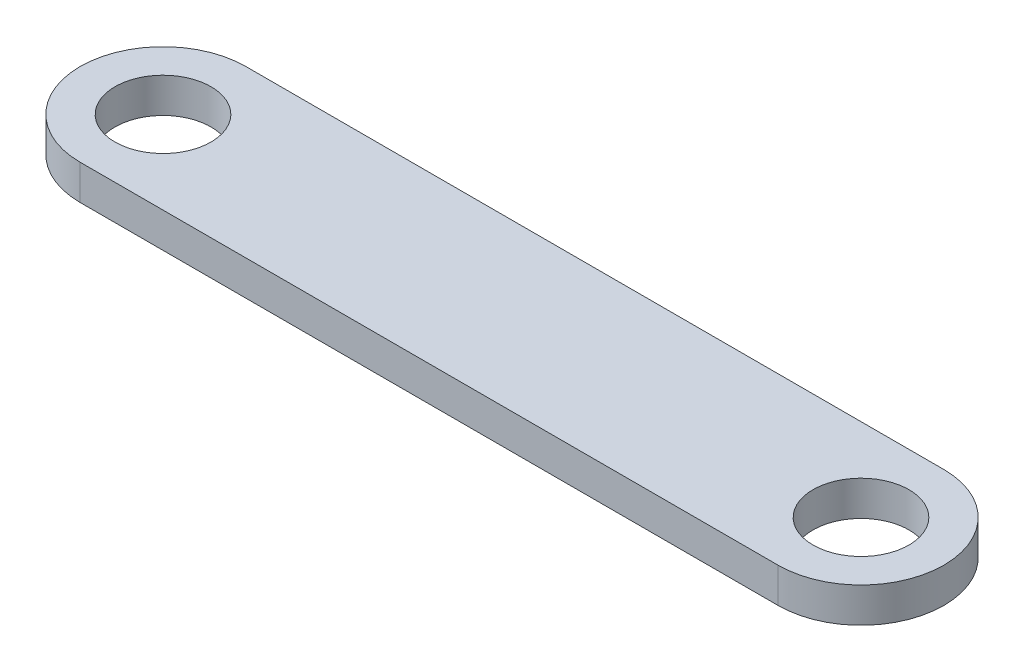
ISO-10303-21;
HEADER;
FILE_DESCRIPTION(('STEP AP214'),'2;1');
FILE_NAME('part.step','',(''),(''),'','','');
FILE_SCHEMA(('AUTOMOTIVE_DESIGN { 1 0 10303 214 1 1 1 1 }'));
ENDSEC;
DATA;
#1=APPLICATION_CONTEXT('core data for automotive mechanical design processes');
#2=APPLICATION_PROTOCOL_DEFINITION('international standard','automotive_design',2000,#1);
#3=PRODUCT_CONTEXT('',#1,'mechanical');
#4=PRODUCT('Part','Part','',(#3));
#5=PRODUCT_RELATED_PRODUCT_CATEGORY('part','',(#4));
#6=PRODUCT_DEFINITION_FORMATION('','',#4);
#7=PRODUCT_DEFINITION_CONTEXT('part definition',#1,'design');
#8=PRODUCT_DEFINITION('design','',#6,#7);
#9=PRODUCT_DEFINITION_SHAPE('','',#8);
#10=(LENGTH_UNIT() NAMED_UNIT(*) SI_UNIT(.MILLI.,.METRE.));
#11=(NAMED_UNIT(*) PLANE_ANGLE_UNIT() SI_UNIT($,.RADIAN.));
#12=(NAMED_UNIT(*) SI_UNIT($,.STERADIAN.) SOLID_ANGLE_UNIT());
#13=UNCERTAINTY_MEASURE_WITH_UNIT(LENGTH_MEASURE(1.E-05),#10,'distance_accuracy_value','');
#14=(GEOMETRIC_REPRESENTATION_CONTEXT(3) GLOBAL_UNCERTAINTY_ASSIGNED_CONTEXT((#13)) GLOBAL_UNIT_ASSIGNED_CONTEXT((#10,
#11,#12)) REPRESENTATION_CONTEXT('',''));
#15=CARTESIAN_POINT('',(0.,0.,0.));
#16=DIRECTION('',(0.,0.,1.));
#17=DIRECTION('',(1.,0.,0.));
#18=AXIS2_PLACEMENT_3D('',#15,#16,#17);
#19=CARTESIAN_POINT('',(-20.,2.,0.));
#20=DIRECTION('',(0.,1.,0.));
#21=DIRECTION('',(0.,0.,1.));
#22=AXIS2_PLACEMENT_3D('',#19,#20,#21);
#23=PLANE('',#22);
#24=CARTESIAN_POINT('',(-20.,2.,0.));
#25=DIRECTION('',(0.,1.,0.));
#26=DIRECTION('',(0.,0.,1.));
#27=AXIS2_PLACEMENT_3D('',#24,#25,#26);
#28=CIRCLE('',#27,2.75);
#29=CARTESIAN_POINT('',(-20.,2.,2.75));
#30=VERTEX_POINT('',#29);
#31=EDGE_CURVE('E113',#30,#30,#28,.T.);
#32=ORIENTED_EDGE('',*,*,#31,.F.);
#33=EDGE_LOOP('',(#32));
#34=FACE_BOUND('',#33,.T.);
#35=CARTESIAN_POINT('',(-20.,2.,0.));
#36=DIRECTION('',(0.,1.,0.));
#37=DIRECTION('',(0.,0.,1.));
#38=AXIS2_PLACEMENT_3D('',#35,#36,#37);
#39=CIRCLE('',#38,4.75);
#40=CARTESIAN_POINT('',(-20.,2.,-4.75));
#41=VERTEX_POINT('',#40);
#42=CARTESIAN_POINT('',(-20.,2.,4.75));
#43=VERTEX_POINT('',#42);
#44=EDGE_CURVE('E92',#41,#43,#39,.T.);
#45=ORIENTED_EDGE('',*,*,#44,.T.);
#46=DIRECTION('',(1.,0.,0.));
#47=VECTOR('',#46,1.);
#48=CARTESIAN_POINT('',(-20.,2.,4.75));
#49=LINE('',#48,#47);
#50=CARTESIAN_POINT('',(20.,2.,4.75));
#51=VERTEX_POINT('',#50);
#52=EDGE_CURVE('E87',#43,#51,#49,.T.);
#53=ORIENTED_EDGE('',*,*,#52,.T.);
#54=CARTESIAN_POINT('',(20.,2.,0.));
#55=DIRECTION('',(0.,1.,0.));
#56=DIRECTION('',(0.,0.,1.));
#57=AXIS2_PLACEMENT_3D('',#54,#55,#56);
#58=CIRCLE('',#57,4.75);
#59=CARTESIAN_POINT('',(20.,2.,-4.75));
#60=VERTEX_POINT('',#59);
#61=EDGE_CURVE('E90',#51,#60,#58,.T.);
#62=ORIENTED_EDGE('',*,*,#61,.T.);
#63=DIRECTION('',(-1.,0.,0.));
#64=VECTOR('',#63,1.);
#65=CARTESIAN_POINT('',(-20.,2.,-4.75));
#66=LINE('',#65,#64);
#67=EDGE_CURVE('E57',#60,#41,#66,.T.);
#68=ORIENTED_EDGE('',*,*,#67,.T.);
#69=EDGE_LOOP('',(#45,#53,#62,#68));
#70=FACE_BOUND('',#69,.T.);
#71=CARTESIAN_POINT('',(20.,2.,0.));
#72=DIRECTION('',(0.,1.,0.));
#73=DIRECTION('',(0.,0.,1.));
#74=AXIS2_PLACEMENT_3D('',#71,#72,#73);
#75=CIRCLE('',#74,2.75);
#76=CARTESIAN_POINT('',(20.,2.,2.75));
#77=VERTEX_POINT('',#76);
#78=EDGE_CURVE('E136',#77,#77,#75,.T.);
#79=ORIENTED_EDGE('',*,*,#78,.F.);
#80=EDGE_LOOP('',(#79));
#81=FACE_BOUND('',#80,.T.);
#82=ADVANCED_FACE('F39',(#34,#70,#81),#23,.T.);
#83=CARTESIAN_POINT('',(-20.,0.,0.));
#84=DIRECTION('',(0.,1.,0.));
#85=DIRECTION('',(0.,0.,1.));
#86=AXIS2_PLACEMENT_3D('',#83,#84,#85);
#87=PLANE('',#86);
#88=CARTESIAN_POINT('',(-20.,0.,0.));
#89=DIRECTION('',(0.,1.,0.));
#90=DIRECTION('',(0.,0.,1.));
#91=AXIS2_PLACEMENT_3D('',#88,#89,#90);
#92=CIRCLE('',#91,4.75);
#93=CARTESIAN_POINT('',(-20.,0.,-4.75));
#94=VERTEX_POINT('',#93);
#95=CARTESIAN_POINT('',(-20.,0.,4.75));
#96=VERTEX_POINT('',#95);
#97=EDGE_CURVE('E109',#94,#96,#92,.T.);
#98=ORIENTED_EDGE('',*,*,#97,.F.);
#99=DIRECTION('',(-1.,0.,0.));
#100=VECTOR('',#99,1.);
#101=CARTESIAN_POINT('',(-20.,0.,-4.75));
#102=LINE('',#101,#100);
#103=CARTESIAN_POINT('',(20.,0.,-4.75));
#104=VERTEX_POINT('',#103);
#105=EDGE_CURVE('E80',#104,#94,#102,.T.);
#106=ORIENTED_EDGE('',*,*,#105,.F.);
#107=CARTESIAN_POINT('',(20.,0.,0.));
#108=DIRECTION('',(0.,1.,0.));
#109=DIRECTION('',(0.,0.,1.));
#110=AXIS2_PLACEMENT_3D('',#107,#108,#109);
#111=CIRCLE('',#110,4.75);
#112=CARTESIAN_POINT('',(20.,0.,4.75));
#113=VERTEX_POINT('',#112);
#114=EDGE_CURVE('E74',#113,#104,#111,.T.);
#115=ORIENTED_EDGE('',*,*,#114,.F.);
#116=DIRECTION('',(1.,0.,0.));
#117=VECTOR('',#116,1.);
#118=CARTESIAN_POINT('',(-20.,0.,4.75));
#119=LINE('',#118,#117);
#120=EDGE_CURVE('E97',#96,#113,#119,.T.);
#121=ORIENTED_EDGE('',*,*,#120,.F.);
#122=EDGE_LOOP('',(#98,#106,#115,#121));
#123=FACE_BOUND('',#122,.T.);
#124=CARTESIAN_POINT('',(-20.,0.,0.));
#125=DIRECTION('',(0.,1.,0.));
#126=DIRECTION('',(0.,0.,1.));
#127=AXIS2_PLACEMENT_3D('',#124,#125,#126);
#128=CIRCLE('',#127,2.75);
#129=CARTESIAN_POINT('',(-20.,0.,2.75));
#130=VERTEX_POINT('',#129);
#131=EDGE_CURVE('E132',#130,#130,#128,.T.);
#132=ORIENTED_EDGE('',*,*,#131,.T.);
#133=EDGE_LOOP('',(#132));
#134=FACE_BOUND('',#133,.T.);
#135=CARTESIAN_POINT('',(20.,0.,0.));
#136=DIRECTION('',(0.,1.,0.));
#137=DIRECTION('',(0.,0.,1.));
#138=AXIS2_PLACEMENT_3D('',#135,#136,#137);
#139=CIRCLE('',#138,2.75);
#140=CARTESIAN_POINT('',(20.,0.,2.75));
#141=VERTEX_POINT('',#140);
#142=EDGE_CURVE('E139',#141,#141,#139,.T.);
#143=ORIENTED_EDGE('',*,*,#142,.T.);
#144=EDGE_LOOP('',(#143));
#145=FACE_BOUND('',#144,.T.);
#146=ADVANCED_FACE('F125',(#123,#134,#145),#87,.F.);
#147=CARTESIAN_POINT('',(-20.,2.,0.));
#148=DIRECTION('',(0.,-1.,0.));
#149=DIRECTION('',(0.,0.,-1.));
#150=AXIS2_PLACEMENT_3D('',#147,#148,#149);
#151=CYLINDRICAL_SURFACE('',#150,4.75);
#152=ORIENTED_EDGE('',*,*,#97,.T.);
#153=DIRECTION('',(0.,-1.,0.));
#154=VECTOR('',#153,1.);
#155=CARTESIAN_POINT('',(-20.,2.,4.75));
#156=LINE('',#155,#154);
#157=EDGE_CURVE('E11',#43,#96,#156,.T.);
#158=ORIENTED_EDGE('',*,*,#157,.F.);
#159=ORIENTED_EDGE('',*,*,#44,.F.);
#160=DIRECTION('',(0.,-1.,0.));
#161=VECTOR('',#160,1.);
#162=CARTESIAN_POINT('',(-20.,2.,-4.75));
#163=LINE('',#162,#161);
#164=EDGE_CURVE('E105',#41,#94,#163,.T.);
#165=ORIENTED_EDGE('',*,*,#164,.T.);
#166=EDGE_LOOP('',(#152,#158,#159,#165));
#167=FACE_BOUND('',#166,.T.);
#168=ADVANCED_FACE('F41',(#167),#151,.T.);
#169=CARTESIAN_POINT('',(-20.,2.,4.75));
#170=DIRECTION('',(0.,0.,-1.));
#171=DIRECTION('',(-1.,0.,0.));
#172=AXIS2_PLACEMENT_3D('',#169,#170,#171);
#173=PLANE('',#172);
#174=ORIENTED_EDGE('',*,*,#120,.T.);
#175=DIRECTION('',(0.,-1.,0.));
#176=VECTOR('',#175,1.);
#177=CARTESIAN_POINT('',(20.,2.,4.75));
#178=LINE('',#177,#176);
#179=EDGE_CURVE('E49',#51,#113,#178,.T.);
#180=ORIENTED_EDGE('',*,*,#179,.F.);
#181=ORIENTED_EDGE('',*,*,#52,.F.);
#182=ORIENTED_EDGE('',*,*,#157,.T.);
#183=EDGE_LOOP('',(#174,#180,#181,#182));
#184=FACE_BOUND('',#183,.T.);
#185=ADVANCED_FACE('F96',(#184),#173,.F.);
#186=CARTESIAN_POINT('',(20.,2.,0.));
#187=DIRECTION('',(0.,-1.,0.));
#188=DIRECTION('',(0.,0.,-1.));
#189=AXIS2_PLACEMENT_3D('',#186,#187,#188);
#190=CYLINDRICAL_SURFACE('',#189,4.75);
#191=ORIENTED_EDGE('',*,*,#114,.T.);
#192=DIRECTION('',(0.,-1.,0.));
#193=VECTOR('',#192,1.);
#194=CARTESIAN_POINT('',(20.,2.,-4.75));
#195=LINE('',#194,#193);
#196=EDGE_CURVE('E99',#60,#104,#195,.T.);
#197=ORIENTED_EDGE('',*,*,#196,.F.);
#198=ORIENTED_EDGE('',*,*,#61,.F.);
#199=ORIENTED_EDGE('',*,*,#179,.T.);
#200=EDGE_LOOP('',(#191,#197,#198,#199));
#201=FACE_BOUND('',#200,.T.);
#202=ADVANCED_FACE('F100',(#201),#190,.T.);
#203=CARTESIAN_POINT('',(-20.,2.,-4.75));
#204=DIRECTION('',(0.,0.,1.));
#205=DIRECTION('',(1.,0.,0.));
#206=AXIS2_PLACEMENT_3D('',#203,#204,#205);
#207=PLANE('',#206);
#208=ORIENTED_EDGE('',*,*,#105,.T.);
#209=ORIENTED_EDGE('',*,*,#164,.F.);
#210=ORIENTED_EDGE('',*,*,#67,.F.);
#211=ORIENTED_EDGE('',*,*,#196,.T.);
#212=EDGE_LOOP('',(#208,#209,#210,#211));
#213=FACE_BOUND('',#212,.T.);
#214=ADVANCED_FACE('F122',(#213),#207,.F.);
#215=CARTESIAN_POINT('',(-20.,2.,0.));
#216=DIRECTION('',(0.,-1.,0.));
#217=DIRECTION('',(0.,0.,-1.));
#218=AXIS2_PLACEMENT_3D('',#215,#216,#217);
#219=CYLINDRICAL_SURFACE('',#218,2.75);
#220=ORIENTED_EDGE('',*,*,#31,.T.);
#221=EDGE_LOOP('',(#220));
#222=FACE_BOUND('',#221,.T.);
#223=ORIENTED_EDGE('',*,*,#131,.F.);
#224=EDGE_LOOP('',(#223));
#225=FACE_BOUND('',#224,.T.);
#226=ADVANCED_FACE('F157',(#222,#225),#219,.F.);
#227=CARTESIAN_POINT('',(20.,2.,0.));
#228=DIRECTION('',(0.,-1.,0.));
#229=DIRECTION('',(0.,0.,-1.));
#230=AXIS2_PLACEMENT_3D('',#227,#228,#229);
#231=CYLINDRICAL_SURFACE('',#230,2.75);
#232=ORIENTED_EDGE('',*,*,#78,.T.);
#233=EDGE_LOOP('',(#232));
#234=FACE_BOUND('',#233,.T.);
#235=ORIENTED_EDGE('',*,*,#142,.F.);
#236=EDGE_LOOP('',(#235));
#237=FACE_BOUND('',#236,.T.);
#238=ADVANCED_FACE('F146',(#234,#237),#231,.F.);
#239=CLOSED_SHELL('',(#82,#146,#168,#185,#202,#214,#226,#238));
#240=MANIFOLD_SOLID_BREP('B2',#239);
#241=ADVANCED_BREP_SHAPE_REPRESENTATION('',(#18,#240),#14);
#242=SHAPE_DEFINITION_REPRESENTATION(#9,#241);
ENDSEC;
END-ISO-10303-21;
